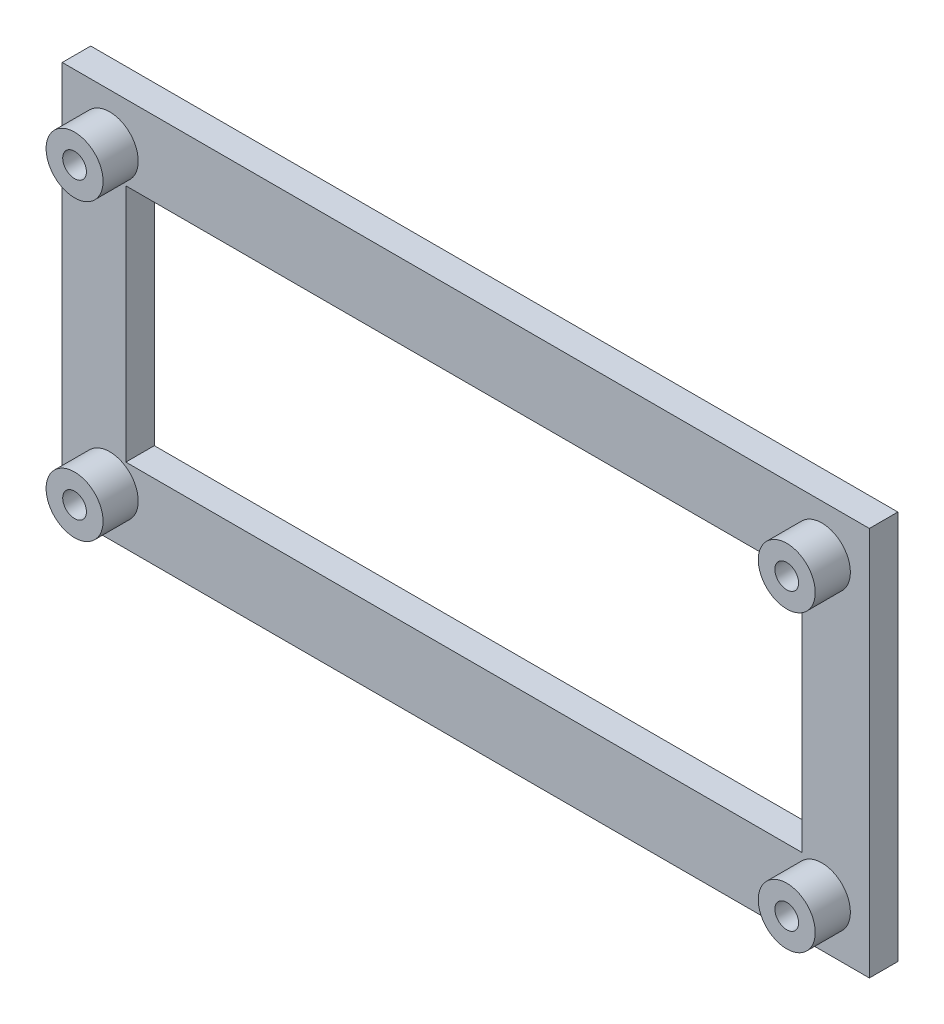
ISO-10303-21;
HEADER;
FILE_DESCRIPTION(('STEP AP214'),'2;1');
FILE_NAME('part.step','',(''),(''),'','','');
FILE_SCHEMA(('AUTOMOTIVE_DESIGN { 1 0 10303 214 1 1 1 1 }'));
ENDSEC;
DATA;
#1=APPLICATION_CONTEXT('core data for automotive mechanical design processes');
#2=APPLICATION_PROTOCOL_DEFINITION('international standard','automotive_design',2000,#1);
#3=PRODUCT_CONTEXT('',#1,'mechanical');
#4=PRODUCT('Part','Part','',(#3));
#5=PRODUCT_RELATED_PRODUCT_CATEGORY('part','',(#4));
#6=PRODUCT_DEFINITION_FORMATION('','',#4);
#7=PRODUCT_DEFINITION_CONTEXT('part definition',#1,'design');
#8=PRODUCT_DEFINITION('design','',#6,#7);
#9=PRODUCT_DEFINITION_SHAPE('','',#8);
#10=(LENGTH_UNIT() NAMED_UNIT(*) SI_UNIT(.MILLI.,.METRE.));
#11=(NAMED_UNIT(*) PLANE_ANGLE_UNIT() SI_UNIT($,.RADIAN.));
#12=(NAMED_UNIT(*) SI_UNIT($,.STERADIAN.) SOLID_ANGLE_UNIT());
#13=UNCERTAINTY_MEASURE_WITH_UNIT(LENGTH_MEASURE(1.E-05),#10,'distance_accuracy_value','');
#14=(GEOMETRIC_REPRESENTATION_CONTEXT(3) GLOBAL_UNCERTAINTY_ASSIGNED_CONTEXT((#13)) GLOBAL_UNIT_ASSIGNED_CONTEXT((#10,
#11,#12)) REPRESENTATION_CONTEXT('',''));
#15=CARTESIAN_POINT('',(0.,0.,0.));
#16=DIRECTION('',(0.,0.,1.));
#17=DIRECTION('',(1.,0.,0.));
#18=AXIS2_PLACEMENT_3D('',#15,#16,#17);
#19=CARTESIAN_POINT('',(0.,12.6,3.));
#20=DIRECTION('',(0.,1.,0.));
#21=DIRECTION('',(0.,0.,1.));
#22=AXIS2_PLACEMENT_3D('',#19,#20,#21);
#23=PLANE('',#22);
#24=DIRECTION('',(1.,0.,0.));
#25=VECTOR('',#24,1.);
#26=CARTESIAN_POINT('',(0.,12.6,0.));
#27=LINE('',#26,#25);
#28=CARTESIAN_POINT('',(-35.8,12.6,0.));
#29=VERTEX_POINT('',#28);
#30=CARTESIAN_POINT('',(35.4,12.6,0.));
#31=VERTEX_POINT('',#30);
#32=EDGE_CURVE('E167',#29,#31,#27,.T.);
#33=ORIENTED_EDGE('',*,*,#32,.T.);
#34=DIRECTION('',(0.,0.,-1.));
#35=VECTOR('',#34,1.);
#36=CARTESIAN_POINT('',(35.4,12.6,3.));
#37=LINE('',#36,#35);
#38=CARTESIAN_POINT('',(35.4,12.6,3.));
#39=VERTEX_POINT('',#38);
#40=EDGE_CURVE('E139',#39,#31,#37,.T.);
#41=ORIENTED_EDGE('',*,*,#40,.F.);
#42=DIRECTION('',(1.,0.,0.));
#43=VECTOR('',#42,1.);
#44=CARTESIAN_POINT('',(0.,12.6,3.));
#45=LINE('',#44,#43);
#46=CARTESIAN_POINT('',(-35.8,12.6,3.));
#47=VERTEX_POINT('',#46);
#48=EDGE_CURVE('E126',#47,#39,#45,.T.);
#49=ORIENTED_EDGE('',*,*,#48,.F.);
#50=DIRECTION('',(0.,0.,-1.));
#51=VECTOR('',#50,1.);
#52=CARTESIAN_POINT('',(-35.8,12.6,3.));
#53=LINE('',#52,#51);
#54=EDGE_CURVE('E65',#47,#29,#53,.T.);
#55=ORIENTED_EDGE('',*,*,#54,.T.);
#56=EDGE_LOOP('',(#33,#41,#49,#55));
#57=FACE_BOUND('',#56,.T.);
#58=ADVANCED_FACE('F47',(#57),#23,.F.);
#59=CARTESIAN_POINT('',(35.4,0.,3.));
#60=DIRECTION('',(1.,0.,0.));
#61=DIRECTION('',(0.,1.,0.));
#62=AXIS2_PLACEMENT_3D('',#59,#60,#61);
#63=PLANE('',#62);
#64=DIRECTION('',(0.,-1.,0.));
#65=VECTOR('',#64,1.);
#66=CARTESIAN_POINT('',(35.4,0.,0.));
#67=LINE('',#66,#65);
#68=CARTESIAN_POINT('',(35.4,-12.6,0.));
#69=VERTEX_POINT('',#68);
#70=EDGE_CURVE('E135',#31,#69,#67,.T.);
#71=ORIENTED_EDGE('',*,*,#70,.T.);
#72=DIRECTION('',(0.,0.,-1.));
#73=VECTOR('',#72,1.);
#74=CARTESIAN_POINT('',(35.4,-12.6,3.));
#75=LINE('',#74,#73);
#76=CARTESIAN_POINT('',(35.4,-12.6,3.));
#77=VERTEX_POINT('',#76);
#78=EDGE_CURVE('E133',#77,#69,#75,.T.);
#79=ORIENTED_EDGE('',*,*,#78,.F.);
#80=DIRECTION('',(0.,-1.,0.));
#81=VECTOR('',#80,1.);
#82=CARTESIAN_POINT('',(35.4,0.,3.));
#83=LINE('',#82,#81);
#84=EDGE_CURVE('E120',#39,#77,#83,.T.);
#85=ORIENTED_EDGE('',*,*,#84,.F.);
#86=ORIENTED_EDGE('',*,*,#40,.T.);
#87=EDGE_LOOP('',(#71,#79,#85,#86));
#88=FACE_BOUND('',#87,.T.);
#89=ADVANCED_FACE('F134',(#88),#63,.F.);
#90=CARTESIAN_POINT('',(0.,-12.6,3.));
#91=DIRECTION('',(0.,1.,0.));
#92=DIRECTION('',(0.,0.,1.));
#93=AXIS2_PLACEMENT_3D('',#90,#91,#92);
#94=PLANE('',#93);
#95=DIRECTION('',(1.,0.,0.));
#96=VECTOR('',#95,1.);
#97=CARTESIAN_POINT('',(0.,-12.6,0.));
#98=LINE('',#97,#96);
#99=CARTESIAN_POINT('',(-35.8,-12.6,0.));
#100=VERTEX_POINT('',#99);
#101=EDGE_CURVE('E172',#100,#69,#98,.T.);
#102=ORIENTED_EDGE('',*,*,#101,.F.);
#103=DIRECTION('',(0.,0.,-1.));
#104=VECTOR('',#103,1.);
#105=CARTESIAN_POINT('',(-35.8,-12.6,3.));
#106=LINE('',#105,#104);
#107=CARTESIAN_POINT('',(-35.8,-12.6,3.));
#108=VERTEX_POINT('',#107);
#109=EDGE_CURVE('E91',#108,#100,#106,.T.);
#110=ORIENTED_EDGE('',*,*,#109,.F.);
#111=DIRECTION('',(1.,0.,0.));
#112=VECTOR('',#111,1.);
#113=CARTESIAN_POINT('',(0.,-12.6,3.));
#114=LINE('',#113,#112);
#115=EDGE_CURVE('E125',#108,#77,#114,.T.);
#116=ORIENTED_EDGE('',*,*,#115,.T.);
#117=ORIENTED_EDGE('',*,*,#78,.T.);
#118=EDGE_LOOP('',(#102,#110,#116,#117));
#119=FACE_BOUND('',#118,.T.);
#120=ADVANCED_FACE('F141',(#119),#94,.T.);
#121=CARTESIAN_POINT('',(0.,-20.5,3.));
#122=DIRECTION('',(0.,1.,0.));
#123=DIRECTION('',(0.,0.,1.));
#124=AXIS2_PLACEMENT_3D('',#121,#122,#123);
#125=PLANE('',#124);
#126=DIRECTION('',(1.,0.,0.));
#127=VECTOR('',#126,1.);
#128=CARTESIAN_POINT('',(0.,-20.5,0.));
#129=LINE('',#128,#127);
#130=CARTESIAN_POINT('',(-42.5,-20.5,0.));
#131=VERTEX_POINT('',#130);
#132=CARTESIAN_POINT('',(42.5,-20.5,0.));
#133=VERTEX_POINT('',#132);
#134=EDGE_CURVE('E150',#131,#133,#129,.T.);
#135=ORIENTED_EDGE('',*,*,#134,.T.);
#136=DIRECTION('',(0.,0.,-1.));
#137=VECTOR('',#136,1.);
#138=CARTESIAN_POINT('',(42.5,-20.5,3.));
#139=LINE('',#138,#137);
#140=CARTESIAN_POINT('',(42.5,-20.5,3.));
#141=VERTEX_POINT('',#140);
#142=EDGE_CURVE('E182',#141,#133,#139,.T.);
#143=ORIENTED_EDGE('',*,*,#142,.F.);
#144=DIRECTION('',(1.,0.,0.));
#145=VECTOR('',#144,1.);
#146=CARTESIAN_POINT('',(0.,-20.5,3.));
#147=LINE('',#146,#145);
#148=CARTESIAN_POINT('',(-42.5,-20.5,3.));
#149=VERTEX_POINT('',#148);
#150=EDGE_CURVE('E179',#149,#141,#147,.T.);
#151=ORIENTED_EDGE('',*,*,#150,.F.);
#152=DIRECTION('',(0.,0.,-1.));
#153=VECTOR('',#152,1.);
#154=CARTESIAN_POINT('',(-42.5,-20.5,3.));
#155=LINE('',#154,#153);
#156=EDGE_CURVE('E146',#149,#131,#155,.T.);
#157=ORIENTED_EDGE('',*,*,#156,.T.);
#158=EDGE_LOOP('',(#135,#143,#151,#157));
#159=FACE_BOUND('',#158,.T.);
#160=ADVANCED_FACE('F49',(#159),#125,.F.);
#161=CARTESIAN_POINT('',(42.5,0.,3.));
#162=DIRECTION('',(-1.,0.,0.));
#163=DIRECTION('',(0.,0.,1.));
#164=AXIS2_PLACEMENT_3D('',#161,#162,#163);
#165=PLANE('',#164);
#166=DIRECTION('',(0.,1.,0.));
#167=VECTOR('',#166,1.);
#168=CARTESIAN_POINT('',(42.5,0.,0.));
#169=LINE('',#168,#167);
#170=CARTESIAN_POINT('',(42.5,20.5,0.));
#171=VERTEX_POINT('',#170);
#172=EDGE_CURVE('E154',#133,#171,#169,.T.);
#173=ORIENTED_EDGE('',*,*,#172,.T.);
#174=DIRECTION('',(0.,0.,-1.));
#175=VECTOR('',#174,1.);
#176=CARTESIAN_POINT('',(42.5,20.5,3.));
#177=LINE('',#176,#175);
#178=CARTESIAN_POINT('',(42.5,20.5,3.));
#179=VERTEX_POINT('',#178);
#180=EDGE_CURVE('E193',#179,#171,#177,.T.);
#181=ORIENTED_EDGE('',*,*,#180,.F.);
#182=DIRECTION('',(0.,1.,0.));
#183=VECTOR('',#182,1.);
#184=CARTESIAN_POINT('',(42.5,0.,3.));
#185=LINE('',#184,#183);
#186=EDGE_CURVE('E104',#141,#179,#185,.T.);
#187=ORIENTED_EDGE('',*,*,#186,.F.);
#188=ORIENTED_EDGE('',*,*,#142,.T.);
#189=EDGE_LOOP('',(#173,#181,#187,#188));
#190=FACE_BOUND('',#189,.T.);
#191=ADVANCED_FACE('F251',(#190),#165,.F.);
#192=CARTESIAN_POINT('',(0.,20.5,3.));
#193=DIRECTION('',(0.,1.,0.));
#194=DIRECTION('',(0.,0.,1.));
#195=AXIS2_PLACEMENT_3D('',#192,#193,#194);
#196=PLANE('',#195);
#197=DIRECTION('',(1.,0.,0.));
#198=VECTOR('',#197,1.);
#199=CARTESIAN_POINT('',(0.,20.5,0.));
#200=LINE('',#199,#198);
#201=CARTESIAN_POINT('',(-42.5,20.5,0.));
#202=VERTEX_POINT('',#201);
#203=EDGE_CURVE('E159',#202,#171,#200,.T.);
#204=ORIENTED_EDGE('',*,*,#203,.F.);
#205=DIRECTION('',(0.,0.,-1.));
#206=VECTOR('',#205,1.);
#207=CARTESIAN_POINT('',(-42.5,20.5,3.));
#208=LINE('',#207,#206);
#209=CARTESIAN_POINT('',(-42.5,20.5,3.));
#210=VERTEX_POINT('',#209);
#211=EDGE_CURVE('E190',#210,#202,#208,.T.);
#212=ORIENTED_EDGE('',*,*,#211,.F.);
#213=DIRECTION('',(1.,0.,0.));
#214=VECTOR('',#213,1.);
#215=CARTESIAN_POINT('',(0.,20.5,3.));
#216=LINE('',#215,#214);
#217=EDGE_CURVE('E267',#210,#179,#216,.T.);
#218=ORIENTED_EDGE('',*,*,#217,.T.);
#219=ORIENTED_EDGE('',*,*,#180,.T.);
#220=EDGE_LOOP('',(#204,#212,#218,#219));
#221=FACE_BOUND('',#220,.T.);
#222=ADVANCED_FACE('F248',(#221),#196,.T.);
#223=CARTESIAN_POINT('',(-42.5,0.,3.));
#224=DIRECTION('',(-1.,0.,0.));
#225=DIRECTION('',(0.,0.,1.));
#226=AXIS2_PLACEMENT_3D('',#223,#224,#225);
#227=PLANE('',#226);
#228=DIRECTION('',(0.,1.,0.));
#229=VECTOR('',#228,1.);
#230=CARTESIAN_POINT('',(-42.5,0.,0.));
#231=LINE('',#230,#229);
#232=EDGE_CURVE('E163',#131,#202,#231,.T.);
#233=ORIENTED_EDGE('',*,*,#232,.F.);
#234=ORIENTED_EDGE('',*,*,#156,.F.);
#235=DIRECTION('',(0.,1.,0.));
#236=VECTOR('',#235,1.);
#237=CARTESIAN_POINT('',(-42.5,0.,3.));
#238=LINE('',#237,#236);
#239=EDGE_CURVE('E272',#149,#210,#238,.T.);
#240=ORIENTED_EDGE('',*,*,#239,.T.);
#241=ORIENTED_EDGE('',*,*,#211,.T.);
#242=EDGE_LOOP('',(#233,#234,#240,#241));
#243=FACE_BOUND('',#242,.T.);
#244=ADVANCED_FACE('F244',(#243),#227,.T.);
#245=CARTESIAN_POINT('',(-35.8,0.,3.));
#246=DIRECTION('',(1.,0.,0.));
#247=DIRECTION('',(0.,1.,0.));
#248=AXIS2_PLACEMENT_3D('',#245,#246,#247);
#249=PLANE('',#248);
#250=DIRECTION('',(0.,-1.,0.));
#251=VECTOR('',#250,1.);
#252=CARTESIAN_POINT('',(-35.8,0.,0.));
#253=LINE('',#252,#251);
#254=EDGE_CURVE('E175',#29,#100,#253,.T.);
#255=ORIENTED_EDGE('',*,*,#254,.F.);
#256=ORIENTED_EDGE('',*,*,#54,.F.);
#257=DIRECTION('',(0.,-1.,0.));
#258=VECTOR('',#257,1.);
#259=CARTESIAN_POINT('',(-35.8,0.,3.));
#260=LINE('',#259,#258);
#261=EDGE_CURVE('E143',#47,#108,#260,.T.);
#262=ORIENTED_EDGE('',*,*,#261,.T.);
#263=ORIENTED_EDGE('',*,*,#109,.T.);
#264=EDGE_LOOP('',(#255,#256,#262,#263));
#265=FACE_BOUND('',#264,.T.);
#266=ADVANCED_FACE('F247',(#265),#249,.T.);
#267=CARTESIAN_POINT('',(0.,0.,3.));
#268=DIRECTION('',(0.,0.,1.));
#269=DIRECTION('',(1.,0.,0.));
#270=AXIS2_PLACEMENT_3D('',#267,#268,#269);
#271=PLANE('',#270);
#272=CARTESIAN_POINT('',(-37.5,-15.5,3.));
#273=DIRECTION('',(0.,0.,1.));
#274=DIRECTION('',(1.,0.,0.));
#275=AXIS2_PLACEMENT_3D('',#272,#273,#274);
#276=CIRCLE('',#275,3.00000000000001);
#277=CARTESIAN_POINT('',(-34.5,-15.5,3.));
#278=VERTEX_POINT('',#277);
#279=EDGE_CURVE('E299',#278,#278,#276,.T.);
#280=ORIENTED_EDGE('',*,*,#279,.F.);
#281=EDGE_LOOP('',(#280));
#282=FACE_BOUND('',#281,.T.);
#283=CARTESIAN_POINT('',(37.5,-15.5,3.));
#284=DIRECTION('',(0.,0.,1.));
#285=DIRECTION('',(1.,0.,0.));
#286=AXIS2_PLACEMENT_3D('',#283,#284,#285);
#287=CIRCLE('',#286,3.);
#288=CARTESIAN_POINT('',(40.5,-15.5,3.));
#289=VERTEX_POINT('',#288);
#290=EDGE_CURVE('E312',#289,#289,#287,.T.);
#291=ORIENTED_EDGE('',*,*,#290,.F.);
#292=EDGE_LOOP('',(#291));
#293=FACE_BOUND('',#292,.T.);
#294=CARTESIAN_POINT('',(37.5,15.5,3.));
#295=DIRECTION('',(0.,0.,1.));
#296=DIRECTION('',(1.,0.,0.));
#297=AXIS2_PLACEMENT_3D('',#294,#295,#296);
#298=CIRCLE('',#297,3.);
#299=CARTESIAN_POINT('',(40.5,15.5,3.));
#300=VERTEX_POINT('',#299);
#301=EDGE_CURVE('E322',#300,#300,#298,.T.);
#302=ORIENTED_EDGE('',*,*,#301,.F.);
#303=EDGE_LOOP('',(#302));
#304=FACE_BOUND('',#303,.T.);
#305=CARTESIAN_POINT('',(-37.5,15.5,3.));
#306=DIRECTION('',(0.,0.,1.));
#307=DIRECTION('',(1.,0.,0.));
#308=AXIS2_PLACEMENT_3D('',#305,#306,#307);
#309=CIRCLE('',#308,3.00000000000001);
#310=CARTESIAN_POINT('',(-34.5,15.5,3.));
#311=VERTEX_POINT('',#310);
#312=EDGE_CURVE('E282',#311,#311,#309,.T.);
#313=ORIENTED_EDGE('',*,*,#312,.F.);
#314=EDGE_LOOP('',(#313));
#315=FACE_BOUND('',#314,.T.);
#316=ORIENTED_EDGE('',*,*,#150,.T.);
#317=ORIENTED_EDGE('',*,*,#186,.T.);
#318=ORIENTED_EDGE('',*,*,#217,.F.);
#319=ORIENTED_EDGE('',*,*,#239,.F.);
#320=EDGE_LOOP('',(#316,#317,#318,#319));
#321=FACE_BOUND('',#320,.T.);
#322=ORIENTED_EDGE('',*,*,#48,.T.);
#323=ORIENTED_EDGE('',*,*,#84,.T.);
#324=ORIENTED_EDGE('',*,*,#115,.F.);
#325=ORIENTED_EDGE('',*,*,#261,.F.);
#326=EDGE_LOOP('',(#322,#323,#324,#325));
#327=FACE_BOUND('',#326,.T.);
#328=ADVANCED_FACE('F122',(#282,#293,#304,#315,#321,#327),#271,.T.);
#329=CARTESIAN_POINT('',(0.,0.,0.));
#330=DIRECTION('',(0.,0.,1.));
#331=DIRECTION('',(1.,0.,0.));
#332=AXIS2_PLACEMENT_3D('',#329,#330,#331);
#333=PLANE('',#332);
#334=ORIENTED_EDGE('',*,*,#134,.F.);
#335=ORIENTED_EDGE('',*,*,#232,.T.);
#336=ORIENTED_EDGE('',*,*,#203,.T.);
#337=ORIENTED_EDGE('',*,*,#172,.F.);
#338=EDGE_LOOP('',(#334,#335,#336,#337));
#339=FACE_BOUND('',#338,.T.);
#340=ORIENTED_EDGE('',*,*,#32,.F.);
#341=ORIENTED_EDGE('',*,*,#254,.T.);
#342=ORIENTED_EDGE('',*,*,#101,.T.);
#343=ORIENTED_EDGE('',*,*,#70,.F.);
#344=EDGE_LOOP('',(#340,#341,#342,#343));
#345=FACE_BOUND('',#344,.T.);
#346=ADVANCED_FACE('F263',(#339,#345),#333,.F.);
#347=CARTESIAN_POINT('',(-37.5,15.5,6.7));
#348=DIRECTION('',(0.,0.,1.));
#349=DIRECTION('',(1.,0.,0.));
#350=AXIS2_PLACEMENT_3D('',#347,#348,#349);
#351=PLANE('',#350);
#352=CARTESIAN_POINT('',(-37.5,15.5,6.7));
#353=DIRECTION('',(0.,0.,1.));
#354=DIRECTION('',(1.,0.,0.));
#355=AXIS2_PLACEMENT_3D('',#352,#353,#354);
#356=CIRCLE('',#355,3.00000000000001);
#357=CARTESIAN_POINT('',(-34.5,15.5,6.7));
#358=VERTEX_POINT('',#357);
#359=EDGE_CURVE('E155',#358,#358,#356,.T.);
#360=ORIENTED_EDGE('',*,*,#359,.T.);
#361=EDGE_LOOP('',(#360));
#362=FACE_BOUND('',#361,.T.);
#363=CARTESIAN_POINT('',(-37.5,15.5,6.7));
#364=DIRECTION('',(0.,0.,1.));
#365=DIRECTION('',(1.,0.,0.));
#366=AXIS2_PLACEMENT_3D('',#363,#364,#365);
#367=CIRCLE('',#366,1.25);
#368=CARTESIAN_POINT('',(-36.25,15.5,6.7));
#369=VERTEX_POINT('',#368);
#370=EDGE_CURVE('E286',#369,#369,#367,.T.);
#371=ORIENTED_EDGE('',*,*,#370,.F.);
#372=EDGE_LOOP('',(#371));
#373=FACE_BOUND('',#372,.T.);
#374=ADVANCED_FACE('F341',(#362,#373),#351,.T.);
#375=CARTESIAN_POINT('',(-37.5,15.5,6.7));
#376=DIRECTION('',(0.,0.,-1.));
#377=DIRECTION('',(-1.,0.,0.));
#378=AXIS2_PLACEMENT_3D('',#375,#376,#377);
#379=CYLINDRICAL_SURFACE('',#378,3.00000000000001);
#380=ORIENTED_EDGE('',*,*,#359,.F.);
#381=EDGE_LOOP('',(#380));
#382=FACE_BOUND('',#381,.T.);
#383=ORIENTED_EDGE('',*,*,#312,.T.);
#384=EDGE_LOOP('',(#383));
#385=FACE_BOUND('',#384,.T.);
#386=ADVANCED_FACE('F338',(#382,#385),#379,.T.);
#387=CARTESIAN_POINT('',(-37.5,15.5,6.7));
#388=DIRECTION('',(0.,0.,-1.));
#389=DIRECTION('',(-1.,0.,0.));
#390=AXIS2_PLACEMENT_3D('',#387,#388,#389);
#391=CYLINDRICAL_SURFACE('',#390,1.25);
#392=ORIENTED_EDGE('',*,*,#370,.T.);
#393=EDGE_LOOP('',(#392));
#394=FACE_BOUND('',#393,.T.);
#395=CARTESIAN_POINT('',(-37.5,15.5,3.));
#396=DIRECTION('',(0.,0.,1.));
#397=DIRECTION('',(1.,0.,0.));
#398=AXIS2_PLACEMENT_3D('',#395,#396,#397);
#399=CIRCLE('',#398,1.25);
#400=CARTESIAN_POINT('',(-36.25,15.5,3.));
#401=VERTEX_POINT('',#400);
#402=EDGE_CURVE('E187',#401,#401,#399,.F.);
#403=ORIENTED_EDGE('',*,*,#402,.T.);
#404=EDGE_LOOP('',(#403));
#405=FACE_BOUND('',#404,.T.);
#406=ADVANCED_FACE('F340',(#394,#405),#391,.F.);
#407=ORIENTED_EDGE('',*,*,#402,.F.);
#408=EDGE_LOOP('',(#407));
#409=FACE_BOUND('',#408,.T.);
#410=ADVANCED_FACE('F232',(#409),#271,.T.);
#411=CARTESIAN_POINT('',(37.5,15.5,6.7));
#412=DIRECTION('',(0.,0.,1.));
#413=DIRECTION('',(1.,0.,0.));
#414=AXIS2_PLACEMENT_3D('',#411,#412,#413);
#415=PLANE('',#414);
#416=CARTESIAN_POINT('',(37.5,15.5,6.7));
#417=DIRECTION('',(0.,0.,1.));
#418=DIRECTION('',(1.,0.,0.));
#419=AXIS2_PLACEMENT_3D('',#416,#417,#418);
#420=CIRCLE('',#419,3.);
#421=CARTESIAN_POINT('',(40.5,15.5,6.7));
#422=VERTEX_POINT('',#421);
#423=EDGE_CURVE('E311',#422,#422,#420,.T.);
#424=ORIENTED_EDGE('',*,*,#423,.T.);
#425=EDGE_LOOP('',(#424));
#426=FACE_BOUND('',#425,.T.);
#427=CARTESIAN_POINT('',(37.5,15.5,6.7));
#428=DIRECTION('',(0.,0.,1.));
#429=DIRECTION('',(1.,0.,0.));
#430=AXIS2_PLACEMENT_3D('',#427,#428,#429);
#431=CIRCLE('',#430,1.25);
#432=CARTESIAN_POINT('',(38.75,15.5,6.7));
#433=VERTEX_POINT('',#432);
#434=EDGE_CURVE('E293',#433,#433,#431,.T.);
#435=ORIENTED_EDGE('',*,*,#434,.F.);
#436=EDGE_LOOP('',(#435));
#437=FACE_BOUND('',#436,.T.);
#438=ADVANCED_FACE('F368',(#426,#437),#415,.T.);
#439=CARTESIAN_POINT('',(37.5,15.5,6.7));
#440=DIRECTION('',(0.,0.,-1.));
#441=DIRECTION('',(-1.,0.,0.));
#442=AXIS2_PLACEMENT_3D('',#439,#440,#441);
#443=CYLINDRICAL_SURFACE('',#442,3.);
#444=ORIENTED_EDGE('',*,*,#423,.F.);
#445=EDGE_LOOP('',(#444));
#446=FACE_BOUND('',#445,.T.);
#447=ORIENTED_EDGE('',*,*,#301,.T.);
#448=EDGE_LOOP('',(#447));
#449=FACE_BOUND('',#448,.T.);
#450=ADVANCED_FACE('F330',(#446,#449),#443,.T.);
#451=CARTESIAN_POINT('',(37.5,15.5,6.7));
#452=DIRECTION('',(0.,0.,-1.));
#453=DIRECTION('',(-1.,0.,0.));
#454=AXIS2_PLACEMENT_3D('',#451,#452,#453);
#455=CYLINDRICAL_SURFACE('',#454,1.25);
#456=ORIENTED_EDGE('',*,*,#434,.T.);
#457=EDGE_LOOP('',(#456));
#458=FACE_BOUND('',#457,.T.);
#459=CARTESIAN_POINT('',(37.5,15.5,3.));
#460=DIRECTION('',(0.,0.,1.));
#461=DIRECTION('',(1.,0.,0.));
#462=AXIS2_PLACEMENT_3D('',#459,#460,#461);
#463=CIRCLE('',#462,1.25);
#464=CARTESIAN_POINT('',(38.75,15.5,3.));
#465=VERTEX_POINT('',#464);
#466=EDGE_CURVE('E201',#465,#465,#463,.F.);
#467=ORIENTED_EDGE('',*,*,#466,.T.);
#468=EDGE_LOOP('',(#467));
#469=FACE_BOUND('',#468,.T.);
#470=ADVANCED_FACE('F230',(#458,#469),#455,.F.);
#471=ORIENTED_EDGE('',*,*,#466,.F.);
#472=EDGE_LOOP('',(#471));
#473=FACE_BOUND('',#472,.T.);
#474=ADVANCED_FACE('F214',(#473),#271,.T.);
#475=CARTESIAN_POINT('',(37.5,-15.5,6.7));
#476=DIRECTION('',(0.,0.,1.));
#477=DIRECTION('',(1.,0.,0.));
#478=AXIS2_PLACEMENT_3D('',#475,#476,#477);
#479=PLANE('',#478);
#480=CARTESIAN_POINT('',(37.5,-15.5,6.7));
#481=DIRECTION('',(0.,0.,1.));
#482=DIRECTION('',(1.,0.,0.));
#483=AXIS2_PLACEMENT_3D('',#480,#481,#482);
#484=CIRCLE('',#483,3.);
#485=CARTESIAN_POINT('',(40.5,-15.5,6.7));
#486=VERTEX_POINT('',#485);
#487=EDGE_CURVE('E298',#486,#486,#484,.T.);
#488=ORIENTED_EDGE('',*,*,#487,.T.);
#489=EDGE_LOOP('',(#488));
#490=FACE_BOUND('',#489,.T.);
#491=CARTESIAN_POINT('',(37.5,-15.5,6.7));
#492=DIRECTION('',(0.,0.,1.));
#493=DIRECTION('',(1.,0.,0.));
#494=AXIS2_PLACEMENT_3D('',#491,#492,#493);
#495=CIRCLE('',#494,1.25);
#496=CARTESIAN_POINT('',(38.75,-15.5,6.7));
#497=VERTEX_POINT('',#496);
#498=EDGE_CURVE('E307',#497,#497,#495,.T.);
#499=ORIENTED_EDGE('',*,*,#498,.F.);
#500=EDGE_LOOP('',(#499));
#501=FACE_BOUND('',#500,.T.);
#502=ADVANCED_FACE('F229',(#490,#501),#479,.T.);
#503=CARTESIAN_POINT('',(37.5,-15.5,6.7));
#504=DIRECTION('',(0.,0.,-1.));
#505=DIRECTION('',(-1.,0.,0.));
#506=AXIS2_PLACEMENT_3D('',#503,#504,#505);
#507=CYLINDRICAL_SURFACE('',#506,3.);
#508=ORIENTED_EDGE('',*,*,#487,.F.);
#509=EDGE_LOOP('',(#508));
#510=FACE_BOUND('',#509,.T.);
#511=ORIENTED_EDGE('',*,*,#290,.T.);
#512=EDGE_LOOP('',(#511));
#513=FACE_BOUND('',#512,.T.);
#514=ADVANCED_FACE('F223',(#510,#513),#507,.T.);
#515=CARTESIAN_POINT('',(37.5,-15.5,6.7));
#516=DIRECTION('',(0.,0.,-1.));
#517=DIRECTION('',(-1.,0.,0.));
#518=AXIS2_PLACEMENT_3D('',#515,#516,#517);
#519=CYLINDRICAL_SURFACE('',#518,1.25);
#520=ORIENTED_EDGE('',*,*,#498,.T.);
#521=EDGE_LOOP('',(#520));
#522=FACE_BOUND('',#521,.T.);
#523=CARTESIAN_POINT('',(37.5,-15.5,3.));
#524=DIRECTION('',(0.,0.,1.));
#525=DIRECTION('',(1.,0.,0.));
#526=AXIS2_PLACEMENT_3D('',#523,#524,#525);
#527=CIRCLE('',#526,1.25);
#528=CARTESIAN_POINT('',(38.75,-15.5,3.));
#529=VERTEX_POINT('',#528);
#530=EDGE_CURVE('E57',#529,#529,#527,.F.);
#531=ORIENTED_EDGE('',*,*,#530,.T.);
#532=EDGE_LOOP('',(#531));
#533=FACE_BOUND('',#532,.T.);
#534=ADVANCED_FACE('F208',(#522,#533),#519,.F.);
#535=ORIENTED_EDGE('',*,*,#530,.F.);
#536=EDGE_LOOP('',(#535));
#537=FACE_BOUND('',#536,.T.);
#538=ADVANCED_FACE('F210',(#537),#271,.T.);
#539=CARTESIAN_POINT('',(-37.5,-15.5,6.7));
#540=DIRECTION('',(0.,0.,1.));
#541=DIRECTION('',(1.,0.,0.));
#542=AXIS2_PLACEMENT_3D('',#539,#540,#541);
#543=PLANE('',#542);
#544=CARTESIAN_POINT('',(-37.5,-15.5,6.7));
#545=DIRECTION('',(0.,0.,1.));
#546=DIRECTION('',(1.,0.,0.));
#547=AXIS2_PLACEMENT_3D('',#544,#545,#546);
#548=CIRCLE('',#547,3.00000000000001);
#549=CARTESIAN_POINT('',(-34.5,-15.5,6.7));
#550=VERTEX_POINT('',#549);
#551=EDGE_CURVE('E300',#550,#550,#548,.T.);
#552=ORIENTED_EDGE('',*,*,#551,.T.);
#553=EDGE_LOOP('',(#552));
#554=FACE_BOUND('',#553,.T.);
#555=CARTESIAN_POINT('',(-37.5,-15.5,6.7));
#556=DIRECTION('',(0.,0.,1.));
#557=DIRECTION('',(1.,0.,0.));
#558=AXIS2_PLACEMENT_3D('',#555,#556,#557);
#559=CIRCLE('',#558,1.25);
#560=CARTESIAN_POINT('',(-36.25,-15.5,6.7));
#561=VERTEX_POINT('',#560);
#562=EDGE_CURVE('E294',#561,#561,#559,.T.);
#563=ORIENTED_EDGE('',*,*,#562,.F.);
#564=EDGE_LOOP('',(#563));
#565=FACE_BOUND('',#564,.T.);
#566=ADVANCED_FACE('F212',(#554,#565),#543,.T.);
#567=CARTESIAN_POINT('',(-37.5,-15.5,6.7));
#568=DIRECTION('',(0.,0.,-1.));
#569=DIRECTION('',(-1.,0.,0.));
#570=AXIS2_PLACEMENT_3D('',#567,#568,#569);
#571=CYLINDRICAL_SURFACE('',#570,3.00000000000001);
#572=ORIENTED_EDGE('',*,*,#551,.F.);
#573=EDGE_LOOP('',(#572));
#574=FACE_BOUND('',#573,.T.);
#575=ORIENTED_EDGE('',*,*,#279,.T.);
#576=EDGE_LOOP('',(#575));
#577=FACE_BOUND('',#576,.T.);
#578=ADVANCED_FACE('F220',(#574,#577),#571,.T.);
#579=CARTESIAN_POINT('',(-37.5,-15.5,6.7));
#580=DIRECTION('',(0.,0.,-1.));
#581=DIRECTION('',(-1.,0.,0.));
#582=AXIS2_PLACEMENT_3D('',#579,#580,#581);
#583=CYLINDRICAL_SURFACE('',#582,1.25);
#584=ORIENTED_EDGE('',*,*,#562,.T.);
#585=EDGE_LOOP('',(#584));
#586=FACE_BOUND('',#585,.T.);
#587=CARTESIAN_POINT('',(-37.5,-15.5,3.));
#588=DIRECTION('',(0.,0.,1.));
#589=DIRECTION('',(1.,0.,0.));
#590=AXIS2_PLACEMENT_3D('',#587,#588,#589);
#591=CIRCLE('',#590,1.25);
#592=CARTESIAN_POINT('',(-36.25,-15.5,3.));
#593=VERTEX_POINT('',#592);
#594=EDGE_CURVE('E11',#593,#593,#591,.F.);
#595=ORIENTED_EDGE('',*,*,#594,.T.);
#596=EDGE_LOOP('',(#595));
#597=FACE_BOUND('',#596,.T.);
#598=ADVANCED_FACE('F234',(#586,#597),#583,.F.);
#599=ORIENTED_EDGE('',*,*,#594,.F.);
#600=EDGE_LOOP('',(#599));
#601=FACE_BOUND('',#600,.T.);
#602=ADVANCED_FACE('F215',(#601),#271,.T.);
#603=CLOSED_SHELL('',(#58,#89,#120,#160,#191,#222,#244,#266,#328,#346,#374,#386,#406,#410,#438,
#450,#470,#474,#502,#514,#534,#538,#566,#578,#598,#602));
#604=MANIFOLD_SOLID_BREP('B2',#603);
#605=ADVANCED_BREP_SHAPE_REPRESENTATION('',(#18,#604),#14);
#606=SHAPE_DEFINITION_REPRESENTATION(#9,#605);
ENDSEC;
END-ISO-10303-21;
